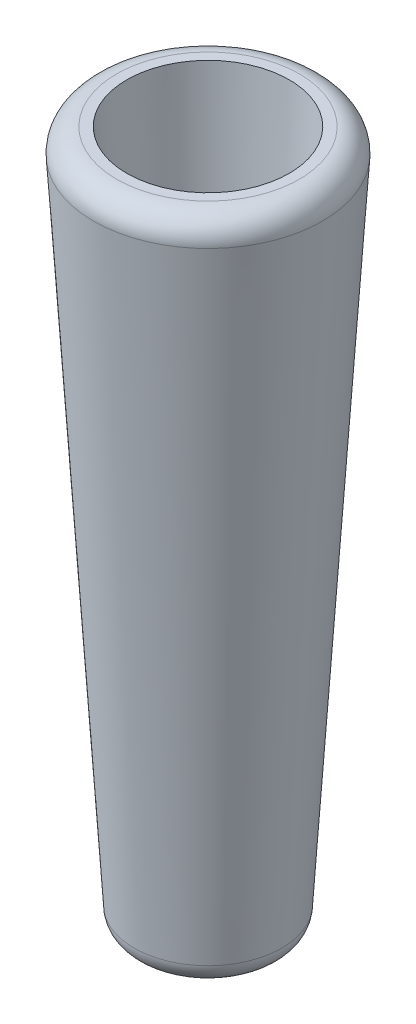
from build123d import *

# Parameters (mm, degrees)
SHELL1_T           = -1.5
SKETCH2_R          = 25
CUT_EXTRUDE1_DEPTH = 10
FILLET1_R          = 1


with BuildPart() as part:
    # Sketch1 → Revolve1 (revolve)
    with BuildSketch(Plane.XY, mode=Mode.PRIVATE) as revolve1_sk:
        Polygon((0, 0), (5, 0), (2.5, -40), (0, -40), align=None)
    revolve(revolve1_sk.sketch.rotate(Axis((0, -40, 0), (0, 1, 0)), 90), axis=Axis((0, -40, 0), (0, 1, 0)))

    # Shell1
    shell1_openings = [part.faces().sort_by_distance(p)[0] for p in [
        (0, 0, 0),
    ]]
    offset(amount=SHELL1_T, openings=shell1_openings, kind=Kind.INTERSECTION)

    # Sketch2 → Cut-Extrude1 (cut)
    with BuildSketch(Plane.XZ.offset(40)):
        Circle(SKETCH2_R)
    extrude(amount=-CUT_EXTRUDE1_DEPTH, mode=Mode.SUBTRACT)

    # Fillet1
    fillet1_edges = [part.edges().sort_by_distance(p)[0] for p in [
        (0, -30, 3.125),
        (0, 0, 5),
    ]]
    fillet(fillet1_edges, radius=FILLET1_R)


solid = part.part
